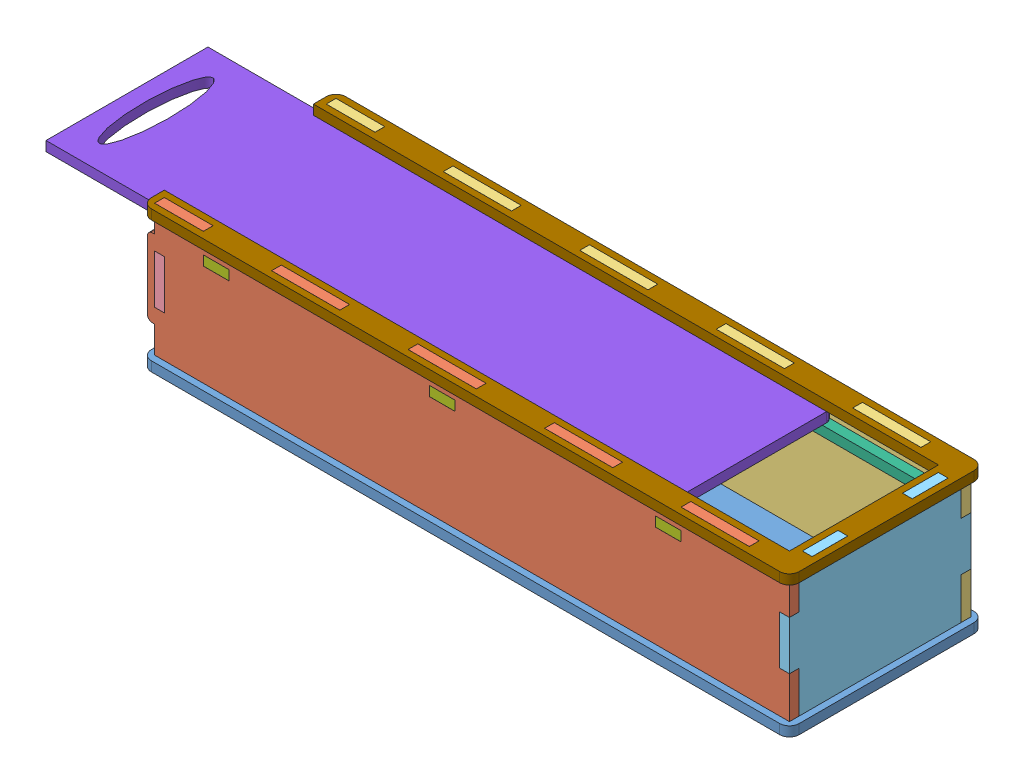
SolidWorks assembly Сборка дальнейшая.SLDASM, configuration Default (file format 9000). Lengths in mm.
Overall size (234.54 43.64 60).
10 component instances, 9 part files, 17 mates.
Components (placement in the parent):
- Сборка стенка и дно-1: Сборка стенка и дно.SLDASM [Default] at (-5.9457 -15.2702 1.4694) size (200.26 43.64 60)
  - Дно пенала-1: Дно пенала.SLDPRT [Default] at (28.2958 105.2102 81.4028) size (200 3 60)
  - боковая стенка 2-1: боковая стенка 2.SLDPRT [Default] at (225.2067 37.2872 136.4028) x (1 0 0) z (0 -1 0) size (198.26 3 43.64)
  - боковая стенка-2: боковая стенка.SLDPRT [Default] at (348.0676 25.6465 83.4028) x (1 0 0) z (0 -1 0) size (198.26 3 43.64)
- торцовая стенка 1-1: торцовая стенка 1.SLDPRT [По умолчанию] at (24.3501 -341.4849 -786.5656) x (0 0 -1) z (0 -1 0) size (56 3 37.34)
- торцовая стенка 2-1: торцовая стенка 2.SLDPRT [По умолчанию] at (217.3501 -341.4849 -786.5656) x (0 0 -1) z (0 -1 0) size (56 3 43.64)
- вставыш-1: вставыш.SLDPRT [Default] at (-94.7904 127.2823 188.4525) x (-1 0 0) z (0 0 1) size (190 3 6)
- вставыш2-1: вставыш2.SLDPRT [Default] at (-94.7905 124.2825 37.2919) x (-1 0 0) z (0 0 -1) size (190 3 6)
- крышка-1: крышка.SLDPRT [По умолчанию] at (56.2835 127.5746 102.3116) size (193 3 50)
- заглушка-2: заглушка.SLDPRT [Default] at (22.3501 130.5746 82.8722) size (200 3 60)
Mates (geometry in assembly coordinates):
- Совпадение3: coincident anti-aligned: plane of Сборка стенка и дно-1/Дно пенала-1 through (24.3501 92.9399 92.8722) normal (1 0 0); plane of торцовая стенка 1-1 through (24.3501 -341.4849 -786.5656) normal (-1 0 0)
- Совпадение4: coincident anti-aligned: plane of Сборка стенка и дно-1/Дно пенала-1 through (24.3501 92.9399 109.6745) normal (0 0 -1); plane of торцовая стенка 1-1 through (27.3501 92.9399 109.6745) normal (0 0 1)
- Совпадение5: coincident anti-aligned: plane of Сборка стенка и дно-1/Дно пенала-1 through (219.3501 92.9399 139.8722) normal (0 1 0); plane of торцовая стенка 1-1 through (27.3501 92.9399 116.0699) normal (0 -1 0)
- Совпадение6: coincident anti-aligned: plane of Сборка стенка и дно-1/Дно пенала-1 through (219.3501 92.9399 139.8722) normal (0 1 0); plane of торцовая стенка 2-1 through (220.3501 92.9399 92.8722) normal (0 -1 0)
- Совпадение7: coincident anti-aligned: plane of Сборка стенка и дно-1/Дно пенала-1 through (217.3501 92.9399 92.8722) normal (1 0 0); plane of торцовая стенка 2-1 through (217.3501 -341.4849 -786.5656) normal (-1 0 0)
- Совпадение8: coincident anti-aligned: plane of Сборка стенка и дно-1/Дно пенала-1 through (217.3501 92.9399 92.8722) normal (0 0 1); plane of торцовая стенка 2-1 through (220.3501 89.9399 92.8722) normal (0 0 -1)
- Совпадение9: coincident anti-aligned: plane of Сборка стенка и дно-1/боковая стенка-2 through (23.6759 102.8194 87.8722) normal (0 0 1); plane of вставыш-1 through (186.8893 124.2823 87.8722) normal (0 0 -1)
- Совпадение10: coincident anti-aligned: plane of Сборка стенка и дно-1/боковая стенка-2 through (47.2385 127.2823 87.8722) normal (0 -1 0); plane of вставыш-1 through (-94.7904 127.2823 188.4525) normal (0 1 0)
- Совпадение11: coincident anti-aligned: plane of Сборка стенка и дно-1/боковая стенка-2 through (39.4001 127.2823 87.8722) normal (1 0 0); plane of вставыш-1 through (39.4001 124.2823 84.8722) normal (-1 0 0)
- Совпадение12: coincident anti-aligned: plane of Сборка стенка и дно-1/боковая стенка 2-1 through (23.6759 102.8195 137.8722) normal (0 0 -1); plane of вставыш2-1 through (186.8892 127.2825 137.8722) normal (0 0 1)
- Совпадение13: coincident anti-aligned: plane of Сборка стенка и дно-1/боковая стенка 2-1 through (47.2384 127.2825 140.8722) normal (0 -1 0); plane of вставыш2-1 through (-94.7905 127.2825 37.2919) normal (0 1 0)
- Совпадение14: coincident anti-aligned: plane of Сборка стенка и дно-1/боковая стенка 2-1 through (39.4 127.2825 140.8722) normal (1 0 0); plane of вставыш2-1 through (39.4 127.2825 140.8722) normal (-1 0 0)
- Совпадение22: coincident anti-aligned: plane of Сборка стенка и дно-1/боковая стенка 2-1 through (207.9589 130.5746 140.8722) normal (0 1 0); plane of заглушка-2 through (219.3501 130.5746 139.8722) normal (0 -1 0)
- Совпадение23: coincident anti-aligned: plane of торцовая стенка 2-1 through (220.3501 130.5746 133.8722) normal (0 0 1); plane of заглушка-2 through (217.3501 133.5746 133.8722) normal (0 0 -1)
- Совпадение24: coincident anti-aligned: plane of торцовая стенка 2-1 through (217.3501 -341.4849 -786.5656) normal (-1 0 0); plane of заглушка-2 through (217.3501 133.5746 122.8722) normal (1 0 0)
- Совпадение25: coincident anti-aligned: plane of Сборка стенка и дно-1/боковая стенка-2 through (23.6759 102.8194 87.8722) normal (0 0 1); plane of крышка-1 through (-12.1874 130.5746 87.8722) normal (0 0 -1)
- Совпадение27: coincident anti-aligned: plane of крышка-1 through (178.8126 130.5746 135.8722) normal (0 1 0); plane of заглушка-2 through (219.3501 130.5746 139.8722) normal (0 -1 0)
